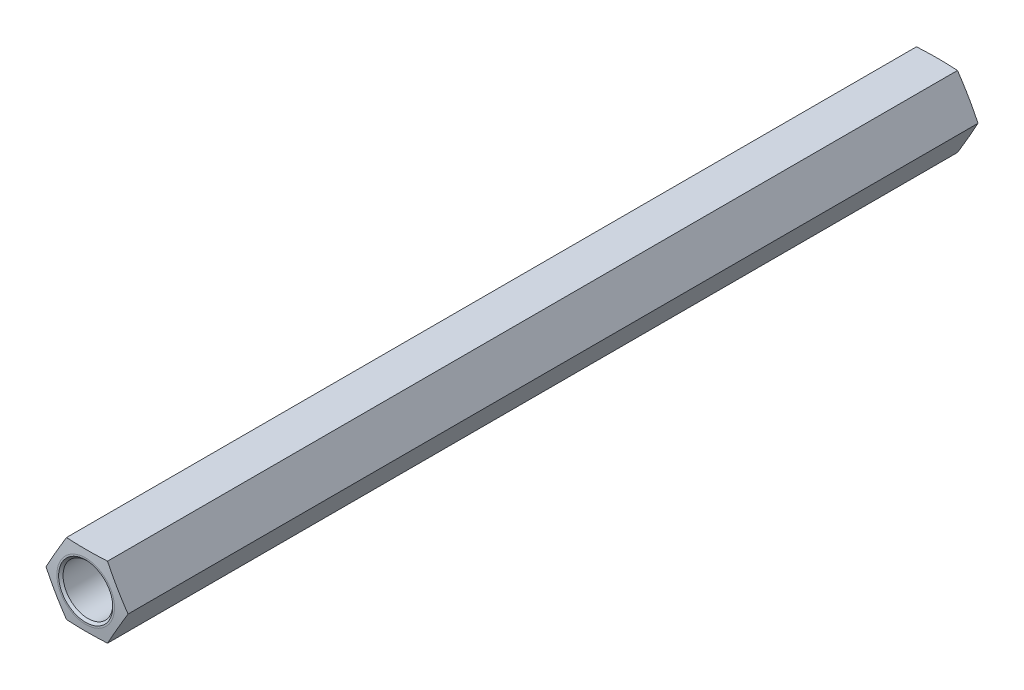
from build123d import *

# Parameters (mm, degrees)
SKETCH1_R      = 2.220000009
EXTRUDE1_DEPTH = 38.1
CHAMFER1_SIZE  = 0.2


with BuildPart() as part:
    # Sketch1 → Extrude1 (new, symmetric)
    with BuildSketch(Plane.XY):
        Polygon((-3.666174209, -6.3e-08), (-1.833087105, -3.175000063), (1.833087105, -3.174999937), (3.666174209, 6.3e-08), (1.833087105, 3.175000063), (-1.833087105, 3.174999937), align=None)
        with Locations(Location((0, -6.3e-08, 0), (0, 0, 180))):
            Circle(SKETCH1_R, mode=Mode.SUBTRACT)
    extrude(amount=EXTRUDE1_DEPTH, both=True)

    # Chamfer1
    chamfer1_edges = [part.edges().sort_by_distance(p)[0] for p in [
        (2.220000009, -6.3e-08, -38.1),
        (2.220000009, -6.3e-08, 38.1),
    ]]
    chamfer(chamfer1_edges, length=CHAMFER1_SIZE)

    # Sketch2 → Cut-Revolve1 (revolve, cut)
    with BuildSketch(Plane.XZ, mode=Mode.PRIVATE) as cut_revolve1_sk:
        Polygon((-2.572739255, -38.1), (-3.666174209, -37.98), (-3.666174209, -38.1), align=None)
    cut_revolve1 = revolve(cut_revolve1_sk.sketch.rotate(Axis((0, -6.3e-08, 38.1), (0, 0, -1)), 179.999998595), axis=Axis((0, -6.3e-08, 38.1), (0, 0, -1)), mode=Mode.SUBTRACT)

    # Mirror1: Cut-Revolve1 across plane
    add(cut_revolve1.mirror(Plane.XY), mode=Mode.SUBTRACT)


solid = part.part
